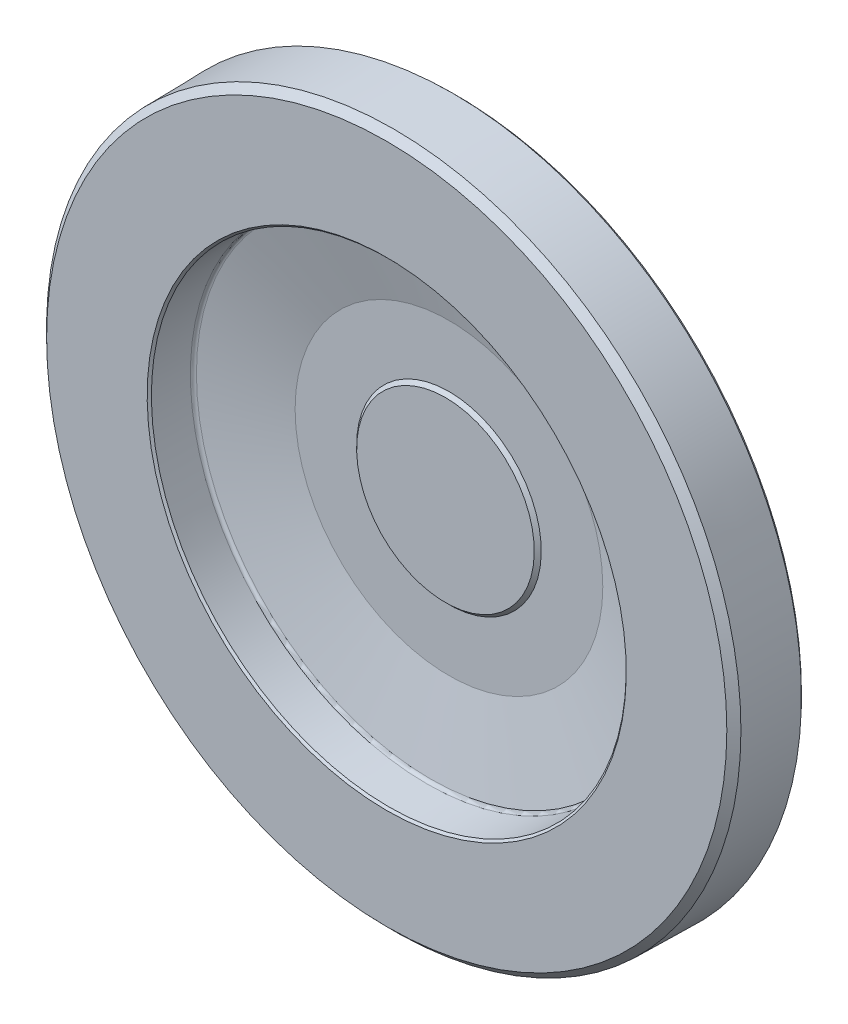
ISO-10303-21;
HEADER;
FILE_DESCRIPTION(('STEP AP214'),'2;1');
FILE_NAME('part.step','',(''),(''),'','','');
FILE_SCHEMA(('AUTOMOTIVE_DESIGN { 1 0 10303 214 1 1 1 1 }'));
ENDSEC;
DATA;
#1=APPLICATION_CONTEXT('core data for automotive mechanical design processes');
#2=APPLICATION_PROTOCOL_DEFINITION('international standard','automotive_design',2000,#1);
#3=PRODUCT_CONTEXT('',#1,'mechanical');
#4=PRODUCT('Part','Part','',(#3));
#5=PRODUCT_RELATED_PRODUCT_CATEGORY('part','',(#4));
#6=PRODUCT_DEFINITION_FORMATION('','',#4);
#7=PRODUCT_DEFINITION_CONTEXT('part definition',#1,'design');
#8=PRODUCT_DEFINITION('design','',#6,#7);
#9=PRODUCT_DEFINITION_SHAPE('','',#8);
#10=(LENGTH_UNIT() NAMED_UNIT(*) SI_UNIT(.MILLI.,.METRE.));
#11=(NAMED_UNIT(*) PLANE_ANGLE_UNIT() SI_UNIT($,.RADIAN.));
#12=(NAMED_UNIT(*) SI_UNIT($,.STERADIAN.) SOLID_ANGLE_UNIT());
#13=UNCERTAINTY_MEASURE_WITH_UNIT(LENGTH_MEASURE(1.E-05),#10,'distance_accuracy_value','');
#14=(GEOMETRIC_REPRESENTATION_CONTEXT(3) GLOBAL_UNCERTAINTY_ASSIGNED_CONTEXT((#13)) GLOBAL_UNIT_ASSIGNED_CONTEXT((#10,
#11,#12)) REPRESENTATION_CONTEXT('',''));
#15=CARTESIAN_POINT('',(0.,0.,0.));
#16=DIRECTION('',(0.,0.,1.));
#17=DIRECTION('',(1.,0.,0.));
#18=AXIS2_PLACEMENT_3D('',#15,#16,#17);
#19=CARTESIAN_POINT('',(0.,0.,44.));
#20=DIRECTION('',(0.,0.,-1.));
#21=DIRECTION('',(0.,1.,0.));
#22=AXIS2_PLACEMENT_3D('',#19,#20,#21);
#23=PLANE('',#22);
#24=CARTESIAN_POINT('',(0.,0.,44.));
#25=DIRECTION('',(0.,0.,-1.));
#26=DIRECTION('',(0.,1.,0.));
#27=AXIS2_PLACEMENT_3D('',#24,#25,#26);
#28=CIRCLE('',#27,31.75);
#29=CARTESIAN_POINT('',(0.,31.75,44.));
#30=VERTEX_POINT('',#29);
#31=EDGE_CURVE('E15',#30,#30,#28,.T.);
#32=ORIENTED_EDGE('',*,*,#31,.F.);
#33=EDGE_LOOP('',(#32));
#34=FACE_BOUND('',#33,.T.);
#35=ADVANCED_FACE('F12',(#34),#23,.F.);
#36=CARTESIAN_POINT('',(0.,0.,42.75));
#37=DIRECTION('',(0.,0.,-1.));
#38=DIRECTION('',(0.,1.,0.));
#39=AXIS2_PLACEMENT_3D('',#36,#37,#38);
#40=CONICAL_SURFACE('',#39,33.,0.785398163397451);
#41=ORIENTED_EDGE('',*,*,#31,.T.);
#42=EDGE_LOOP('',(#41));
#43=FACE_BOUND('',#42,.T.);
#44=CARTESIAN_POINT('',(0.,0.,42.75));
#45=DIRECTION('',(0.,0.,-1.));
#46=DIRECTION('',(0.,1.,0.));
#47=AXIS2_PLACEMENT_3D('',#44,#45,#46);
#48=CIRCLE('',#47,33.);
#49=CARTESIAN_POINT('',(0.,33.,42.75));
#50=VERTEX_POINT('',#49);
#51=EDGE_CURVE('E54',#50,#50,#48,.F.);
#52=ORIENTED_EDGE('',*,*,#51,.T.);
#53=EDGE_LOOP('',(#52));
#54=FACE_BOUND('',#53,.T.);
#55=ADVANCED_FACE('F61',(#43,#54),#40,.T.);
#56=CARTESIAN_POINT('',(23.75,0.,0.));
#57=DIRECTION('',(0.,0.,1.));
#58=DIRECTION('',(0.,-1.,0.));
#59=AXIS2_PLACEMENT_3D('',#56,#57,#58);
#60=PLANE('',#59);
#61=CARTESIAN_POINT('',(0.,0.,0.));
#62=DIRECTION('',(0.,0.,1.));
#63=DIRECTION('',(-1.,0.,0.));
#64=AXIS2_PLACEMENT_3D('',#61,#62,#63);
#65=CIRCLE('',#64,23.75);
#66=CARTESIAN_POINT('',(-23.75,0.,0.));
#67=VERTEX_POINT('',#66);
#68=EDGE_CURVE('E52',#67,#67,#65,.T.);
#69=ORIENTED_EDGE('',*,*,#68,.F.);
#70=EDGE_LOOP('',(#69));
#71=FACE_BOUND('',#70,.T.);
#72=ADVANCED_FACE('F68',(#71),#60,.F.);
#73=CARTESIAN_POINT('',(33.,0.,42.75));
#74=DIRECTION('',(0.,0.,-1.));
#75=DIRECTION('',(0.,1.,0.));
#76=AXIS2_PLACEMENT_3D('',#73,#74,#75);
#77=PLANE('',#76);
#78=ORIENTED_EDGE('',*,*,#51,.F.);
#79=EDGE_LOOP('',(#78));
#80=FACE_BOUND('',#79,.T.);
#81=CARTESIAN_POINT('',(0.,0.,42.75));
#82=DIRECTION('',(0.,0.,1.));
#83=DIRECTION('',(-1.,0.,0.));
#84=AXIS2_PLACEMENT_3D('',#81,#82,#83);
#85=CIRCLE('',#84,55.);
#86=CARTESIAN_POINT('',(-55.,0.,42.75));
#87=VERTEX_POINT('',#86);
#88=EDGE_CURVE('E48',#87,#87,#85,.T.);
#89=ORIENTED_EDGE('',*,*,#88,.T.);
#90=EDGE_LOOP('',(#89));
#91=FACE_BOUND('',#90,.T.);
#92=ADVANCED_FACE('F159',(#80,#91),#77,.F.);
#93=CARTESIAN_POINT('',(0.,0.,0.75));
#94=DIRECTION('',(0.,0.,1.));
#95=DIRECTION('',(-1.,0.,0.));
#96=AXIS2_PLACEMENT_3D('',#93,#94,#95);
#97=CONICAL_SURFACE('',#96,24.5,0.785398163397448);
#98=CARTESIAN_POINT('',(0.,0.,0.75));
#99=DIRECTION('',(0.,0.,1.));
#100=DIRECTION('',(0.,-1.,0.));
#101=AXIS2_PLACEMENT_3D('',#98,#99,#100);
#102=CIRCLE('',#101,24.5);
#103=CARTESIAN_POINT('',(0.,-24.5,0.75));
#104=VERTEX_POINT('',#103);
#105=EDGE_CURVE('E51',#104,#104,#102,.T.);
#106=ORIENTED_EDGE('',*,*,#105,.F.);
#107=EDGE_LOOP('',(#106));
#108=FACE_BOUND('',#107,.T.);
#109=ORIENTED_EDGE('',*,*,#68,.T.);
#110=EDGE_LOOP('',(#109));
#111=FACE_BOUND('',#110,.T.);
#112=ADVANCED_FACE('F155',(#108,#111),#97,.T.);
#113=CARTESIAN_POINT('',(0.,0.,49.3675614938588));
#114=DIRECTION('',(0.,0.,1.));
#115=DIRECTION('',(-1.,0.,0.));
#116=AXIS2_PLACEMENT_3D('',#113,#114,#115);
#117=CONICAL_SURFACE('',#116,83.6638079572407,1.34390352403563);
#118=ORIENTED_EDGE('',*,*,#88,.F.);
#119=EDGE_LOOP('',(#118));
#120=FACE_BOUND('',#119,.T.);
#121=CARTESIAN_POINT('',(0.,0.,49.3675614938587));
#122=DIRECTION('',(0.,0.,-1.));
#123=DIRECTION('',(0.,1.,0.));
#124=AXIS2_PLACEMENT_3D('',#121,#122,#123);
#125=CIRCLE('',#124,83.6638079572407);
#126=CARTESIAN_POINT('',(0.,83.6638079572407,49.3675614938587));
#127=VERTEX_POINT('',#126);
#128=EDGE_CURVE('E47',#127,#127,#125,.F.);
#129=ORIENTED_EDGE('',*,*,#128,.T.);
#130=EDGE_LOOP('',(#129));
#131=FACE_BOUND('',#130,.T.);
#132=ADVANCED_FACE('F158',(#120,#131),#117,.F.);
#133=CARTESIAN_POINT('',(0.,0.,0.));
#134=DIRECTION('',(0.,0.,1.));
#135=DIRECTION('',(0.,-1.,0.));
#136=AXIS2_PLACEMENT_3D('',#133,#134,#135);
#137=CYLINDRICAL_SURFACE('',#136,24.5);
#138=CARTESIAN_POINT('',(0.,0.,15.));
#139=DIRECTION('',(0.,0.,1.));
#140=DIRECTION('',(0.,-1.,0.));
#141=AXIS2_PLACEMENT_3D('',#138,#139,#140);
#142=CIRCLE('',#141,24.5);
#143=CARTESIAN_POINT('',(0.,-24.5,15.));
#144=VERTEX_POINT('',#143);
#145=EDGE_CURVE('E44',#144,#144,#142,.F.);
#146=ORIENTED_EDGE('',*,*,#145,.T.);
#147=EDGE_LOOP('',(#146));
#148=FACE_BOUND('',#147,.T.);
#149=ORIENTED_EDGE('',*,*,#105,.T.);
#150=EDGE_LOOP('',(#149));
#151=FACE_BOUND('',#150,.T.);
#152=ADVANCED_FACE('F140',(#148,#151),#137,.T.);
#153=CARTESIAN_POINT('',(0.,0.,50.5855240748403));
#154=DIRECTION('',(0.,0.,-1.));
#155=DIRECTION('',(0.,1.,0.));
#156=AXIS2_PLACEMENT_3D('',#153,#154,#155);
#157=TOROIDAL_SURFACE('',#156,83.3826191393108,1.25000000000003);
#158=ORIENTED_EDGE('',*,*,#128,.F.);
#159=EDGE_LOOP('',(#158));
#160=FACE_BOUND('',#159,.T.);
#161=CARTESIAN_POINT('',(0.,0.,50.563708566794));
#162=DIRECTION('',(0.,0.,1.));
#163=DIRECTION('',(0.,-1.,0.));
#164=AXIS2_PLACEMENT_3D('',#161,#162,#163);
#165=CIRCLE('',#164,84.6324287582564);
#166=CARTESIAN_POINT('',(0.,-84.6324287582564,50.5637085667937));
#167=VERTEX_POINT('',#166);
#168=EDGE_CURVE('E43',#167,#167,#165,.T.);
#169=ORIENTED_EDGE('',*,*,#168,.T.);
#170=EDGE_LOOP('',(#169));
#171=FACE_BOUND('',#170,.T.);
#172=ADVANCED_FACE('F135',(#160,#171),#157,.F.);
#173=CARTESIAN_POINT('',(35.,0.,15.));
#174=DIRECTION('',(0.,0.,1.));
#175=DIRECTION('',(0.,-1.,0.));
#176=AXIS2_PLACEMENT_3D('',#173,#174,#175);
#177=PLANE('',#176);
#178=CARTESIAN_POINT('',(0.,0.,15.));
#179=DIRECTION('',(0.,0.,1.));
#180=DIRECTION('',(0.,-1.,0.));
#181=AXIS2_PLACEMENT_3D('',#178,#179,#180);
#182=CIRCLE('',#181,35.);
#183=CARTESIAN_POINT('',(0.,-35.,15.));
#184=VERTEX_POINT('',#183);
#185=EDGE_CURVE('E39',#184,#184,#182,.T.);
#186=ORIENTED_EDGE('',*,*,#185,.F.);
#187=EDGE_LOOP('',(#186));
#188=FACE_BOUND('',#187,.T.);
#189=ORIENTED_EDGE('',*,*,#145,.F.);
#190=EDGE_LOOP('',(#189));
#191=FACE_BOUND('',#190,.T.);
#192=ADVANCED_FACE('F131',(#188,#191),#177,.F.);
#193=CARTESIAN_POINT('',(0.,0.,64.2501142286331));
#194=DIRECTION('',(0.,0.,1.));
#195=DIRECTION('',(0.,-1.,0.));
#196=AXIS2_PLACEMENT_3D('',#193,#194,#195);
#197=CONICAL_SURFACE('',#196,84.8713258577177,0.0174532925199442);
#198=ORIENTED_EDGE('',*,*,#168,.F.);
#199=EDGE_LOOP('',(#198));
#200=FACE_BOUND('',#199,.T.);
#201=CARTESIAN_POINT('',(0.,0.,64.2501142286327));
#202=DIRECTION('',(0.,0.,1.));
#203=DIRECTION('',(0.,-1.,0.));
#204=AXIS2_PLACEMENT_3D('',#201,#202,#203);
#205=CIRCLE('',#204,84.8713258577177);
#206=CARTESIAN_POINT('',(0.,-84.8713258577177,64.2501142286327));
#207=VERTEX_POINT('',#206);
#208=EDGE_CURVE('E42',#207,#207,#205,.T.);
#209=ORIENTED_EDGE('',*,*,#208,.T.);
#210=EDGE_LOOP('',(#209));
#211=FACE_BOUND('',#210,.T.);
#212=ADVANCED_FACE('F127',(#200,#211),#197,.F.);
#213=CARTESIAN_POINT('',(0.,0.,0.));
#214=DIRECTION('',(0.,0.,1.));
#215=DIRECTION('',(0.,-1.,0.));
#216=AXIS2_PLACEMENT_3D('',#213,#214,#215);
#217=CYLINDRICAL_SURFACE('',#216,35.);
#218=CARTESIAN_POINT('',(0.,0.,25.6909579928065));
#219=DIRECTION('',(0.,0.,-1.));
#220=DIRECTION('',(0.,1.,0.));
#221=AXIS2_PLACEMENT_3D('',#218,#219,#220);
#222=CIRCLE('',#221,35.);
#223=CARTESIAN_POINT('',(0.,35.,25.6909579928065));
#224=VERTEX_POINT('',#223);
#225=EDGE_CURVE('E38',#224,#224,#222,.T.);
#226=ORIENTED_EDGE('',*,*,#225,.T.);
#227=EDGE_LOOP('',(#226));
#228=FACE_BOUND('',#227,.T.);
#229=ORIENTED_EDGE('',*,*,#185,.T.);
#230=EDGE_LOOP('',(#229));
#231=FACE_BOUND('',#230,.T.);
#232=ADVANCED_FACE('F123',(#228,#231),#217,.T.);
#233=CARTESIAN_POINT('',(0.,0.,65.));
#234=DIRECTION('',(0.,0.,1.));
#235=DIRECTION('',(0.,-1.,0.));
#236=AXIS2_PLACEMENT_3D('',#233,#234,#235);
#237=CONICAL_SURFACE('',#236,85.6344151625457,0.79412480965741);
#238=ORIENTED_EDGE('',*,*,#208,.F.);
#239=EDGE_LOOP('',(#238));
#240=FACE_BOUND('',#239,.T.);
#241=CARTESIAN_POINT('',(0.,0.,65.));
#242=DIRECTION('',(0.,0.,1.));
#243=DIRECTION('',(0.,-1.,0.));
#244=AXIS2_PLACEMENT_3D('',#241,#242,#243);
#245=CIRCLE('',#244,85.6344151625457);
#246=CARTESIAN_POINT('',(0.,-85.6344151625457,65.));
#247=VERTEX_POINT('',#246);
#248=EDGE_CURVE('E35',#247,#247,#245,.T.);
#249=ORIENTED_EDGE('',*,*,#248,.T.);
#250=EDGE_LOOP('',(#249));
#251=FACE_BOUND('',#250,.T.);
#252=ADVANCED_FACE('F119',(#240,#251),#237,.F.);
#253=CARTESIAN_POINT('',(0.,0.,25.6909579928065));
#254=DIRECTION('',(0.,0.,-1.));
#255=DIRECTION('',(0.,1.,0.));
#256=AXIS2_PLACEMENT_3D('',#253,#254,#255);
#257=TOROIDAL_SURFACE('',#256,37.5,2.5);
#258=CARTESIAN_POINT('',(0.,0.,28.0401895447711));
#259=DIRECTION('',(0.,0.,1.));
#260=DIRECTION('',(0.,-1.,0.));
#261=AXIS2_PLACEMENT_3D('',#258,#259,#260);
#262=CIRCLE('',#261,36.6449496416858);
#263=CARTESIAN_POINT('',(0.,-36.6449496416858,28.0401895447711));
#264=VERTEX_POINT('',#263);
#265=EDGE_CURVE('E34',#264,#264,#262,.T.);
#266=ORIENTED_EDGE('',*,*,#265,.F.);
#267=EDGE_LOOP('',(#266));
#268=FACE_BOUND('',#267,.T.);
#269=ORIENTED_EDGE('',*,*,#225,.F.);
#270=EDGE_LOOP('',(#269));
#271=FACE_BOUND('',#270,.T.);
#272=ADVANCED_FACE('F114',(#268,#271),#257,.F.);
#273=CARTESIAN_POINT('',(85.6344151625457,0.,65.));
#274=DIRECTION('',(0.,0.,-1.));
#275=DIRECTION('',(0.,1.,0.));
#276=AXIS2_PLACEMENT_3D('',#273,#274,#275);
#277=PLANE('',#276);
#278=ORIENTED_EDGE('',*,*,#248,.F.);
#279=EDGE_LOOP('',(#278));
#280=FACE_BOUND('',#279,.T.);
#281=CARTESIAN_POINT('',(0.,0.,65.));
#282=DIRECTION('',(0.,0.,-1.));
#283=DIRECTION('',(1.,0.,0.));
#284=AXIS2_PLACEMENT_3D('',#281,#282,#283);
#285=CIRCLE('',#284,121.585442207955);
#286=CARTESIAN_POINT('',(121.585442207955,0.,65.));
#287=VERTEX_POINT('',#286);
#288=EDGE_CURVE('E30',#287,#287,#285,.T.);
#289=ORIENTED_EDGE('',*,*,#288,.F.);
#290=EDGE_LOOP('',(#289));
#291=FACE_BOUND('',#290,.T.);
#292=ADVANCED_FACE('F118',(#280,#291),#277,.F.);
#293=CARTESIAN_POINT('',(0.,0.,44.8894307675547));
#294=DIRECTION('',(0.,0.,1.));
#295=DIRECTION('',(0.,-1.,0.));
#296=AXIS2_PLACEMENT_3D('',#293,#294,#295);
#297=CONICAL_SURFACE('',#296,82.9378594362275,1.22173047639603);
#298=CARTESIAN_POINT('',(0.,0.,44.8894307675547));
#299=DIRECTION('',(0.,0.,-1.));
#300=DIRECTION('',(0.,1.,0.));
#301=AXIS2_PLACEMENT_3D('',#298,#299,#300);
#302=CIRCLE('',#301,82.9378594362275);
#303=CARTESIAN_POINT('',(0.,82.9378594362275,44.8894307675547));
#304=VERTEX_POINT('',#303);
#305=EDGE_CURVE('E33',#304,#304,#302,.T.);
#306=ORIENTED_EDGE('',*,*,#305,.T.);
#307=EDGE_LOOP('',(#306));
#308=FACE_BOUND('',#307,.T.);
#309=ORIENTED_EDGE('',*,*,#265,.T.);
#310=EDGE_LOOP('',(#309));
#311=FACE_BOUND('',#310,.T.);
#312=ADVANCED_FACE('F201',(#308,#311),#297,.T.);
#313=CARTESIAN_POINT('',(0.,0.,62.5003807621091));
#314=DIRECTION('',(0.,0.,-1.));
#315=DIRECTION('',(1.,0.,0.));
#316=AXIS2_PLACEMENT_3D('',#313,#314,#315);
#317=CONICAL_SURFACE('',#316,124.129073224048,0.794124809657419);
#318=ORIENTED_EDGE('',*,*,#288,.T.);
#319=EDGE_LOOP('',(#318));
#320=FACE_BOUND('',#319,.T.);
#321=CARTESIAN_POINT('',(0.,0.,62.500380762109));
#322=DIRECTION('',(0.,0.,-1.));
#323=DIRECTION('',(0.,1.,0.));
#324=AXIS2_PLACEMENT_3D('',#321,#322,#323);
#325=CIRCLE('',#324,124.129073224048);
#326=CARTESIAN_POINT('',(0.,124.129073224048,62.5003807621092));
#327=VERTEX_POINT('',#326);
#328=EDGE_CURVE('E103',#327,#327,#325,.T.);
#329=ORIENTED_EDGE('',*,*,#328,.F.);
#330=EDGE_LOOP('',(#329));
#331=FACE_BOUND('',#330,.T.);
#332=ADVANCED_FACE('F93',(#320,#331),#317,.T.);
#333=CARTESIAN_POINT('',(0.,0.,43.7148149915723));
#334=DIRECTION('',(0.,0.,-1.));
#335=DIRECTION('',(0.,1.,0.));
#336=AXIS2_PLACEMENT_3D('',#333,#334,#335);
#337=TOROIDAL_SURFACE('',#336,83.3653846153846,1.25000000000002);
#338=CARTESIAN_POINT('',(0.,0.,43.7148149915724));
#339=DIRECTION('',(0.,0.,1.));
#340=DIRECTION('',(0.,-1.,0.));
#341=AXIS2_PLACEMENT_3D('',#338,#339,#340);
#342=CIRCLE('',#341,84.6153846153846);
#343=CARTESIAN_POINT('',(0.,-84.6153846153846,43.7148149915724));
#344=VERTEX_POINT('',#343);
#345=EDGE_CURVE('E208',#344,#344,#342,.F.);
#346=ORIENTED_EDGE('',*,*,#345,.T.);
#347=EDGE_LOOP('',(#346));
#348=FACE_BOUND('',#347,.T.);
#349=ORIENTED_EDGE('',*,*,#305,.F.);
#350=EDGE_LOOP('',(#349));
#351=FACE_BOUND('',#350,.T.);
#352=ADVANCED_FACE('F88',(#348,#351),#337,.F.);
#353=CARTESIAN_POINT('',(0.,0.,41.2498096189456));
#354=DIRECTION('',(0.,0.,-1.));
#355=DIRECTION('',(0.,1.,0.));
#356=AXIS2_PLACEMENT_3D('',#353,#354,#355);
#357=CONICAL_SURFACE('',#356,124.500003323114,0.0174532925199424);
#358=ORIENTED_EDGE('',*,*,#328,.T.);
#359=EDGE_LOOP('',(#358));
#360=FACE_BOUND('',#359,.T.);
#361=CARTESIAN_POINT('',(0.,0.,41.2498096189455));
#362=DIRECTION('',(0.,0.,1.));
#363=DIRECTION('',(0.,-1.,0.));
#364=AXIS2_PLACEMENT_3D('',#361,#362,#363);
#365=CIRCLE('',#364,124.500003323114);
#366=CARTESIAN_POINT('',(0.,-124.500003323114,41.2498096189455));
#367=VERTEX_POINT('',#366);
#368=EDGE_CURVE('E24',#367,#367,#365,.F.);
#369=ORIENTED_EDGE('',*,*,#368,.F.);
#370=EDGE_LOOP('',(#369));
#371=FACE_BOUND('',#370,.T.);
#372=ADVANCED_FACE('F84',(#360,#371),#357,.T.);
#373=CARTESIAN_POINT('',(0.,0.,0.));
#374=DIRECTION('',(0.,0.,1.));
#375=DIRECTION('',(0.,-1.,0.));
#376=AXIS2_PLACEMENT_3D('',#373,#374,#375);
#377=CYLINDRICAL_SURFACE('',#376,84.6153846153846);
#378=CARTESIAN_POINT('',(0.,0.,40.));
#379=DIRECTION('',(0.,0.,1.));
#380=DIRECTION('',(0.,-1.,0.));
#381=AXIS2_PLACEMENT_3D('',#378,#379,#380);
#382=CIRCLE('',#381,84.6153846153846);
#383=CARTESIAN_POINT('',(0.,-84.6153846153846,40.));
#384=VERTEX_POINT('',#383);
#385=EDGE_CURVE('E19',#384,#384,#382,.F.);
#386=ORIENTED_EDGE('',*,*,#385,.T.);
#387=EDGE_LOOP('',(#386));
#388=FACE_BOUND('',#387,.T.);
#389=ORIENTED_EDGE('',*,*,#345,.F.);
#390=EDGE_LOOP('',(#389));
#391=FACE_BOUND('',#390,.T.);
#392=ADVANCED_FACE('F77',(#388,#391),#377,.F.);
#393=CARTESIAN_POINT('',(0.,0.,41.2498096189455));
#394=DIRECTION('',(0.,0.,1.));
#395=DIRECTION('',(0.,-1.,0.));
#396=AXIS2_PLACEMENT_3D('',#393,#394,#395);
#397=CONICAL_SURFACE('',#396,124.500003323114,0.776671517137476);
#398=ORIENTED_EDGE('',*,*,#368,.T.);
#399=EDGE_LOOP('',(#398));
#400=FACE_BOUND('',#399,.T.);
#401=CARTESIAN_POINT('',(0.,0.,40.));
#402=DIRECTION('',(0.,0.,1.));
#403=DIRECTION('',(0.,-1.,0.));
#404=AXIS2_PLACEMENT_3D('',#401,#402,#403);
#405=CIRCLE('',#404,123.27181883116);
#406=CARTESIAN_POINT('',(0.,-123.27181883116,40.));
#407=VERTEX_POINT('',#406);
#408=EDGE_CURVE('E8',#407,#407,#405,.T.);
#409=ORIENTED_EDGE('',*,*,#408,.T.);
#410=EDGE_LOOP('',(#409));
#411=FACE_BOUND('',#410,.T.);
#412=ADVANCED_FACE('F71',(#400,#411),#397,.T.);
#413=CARTESIAN_POINT('',(123.27181883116,0.,40.));
#414=DIRECTION('',(0.,0.,1.));
#415=DIRECTION('',(0.,-1.,0.));
#416=AXIS2_PLACEMENT_3D('',#413,#414,#415);
#417=PLANE('',#416);
#418=ORIENTED_EDGE('',*,*,#408,.F.);
#419=EDGE_LOOP('',(#418));
#420=FACE_BOUND('',#419,.T.);
#421=ORIENTED_EDGE('',*,*,#385,.F.);
#422=EDGE_LOOP('',(#421));
#423=FACE_BOUND('',#422,.T.);
#424=ADVANCED_FACE('F69',(#420,#423),#417,.F.);
#425=CLOSED_SHELL('',(#35,#55,#72,#92,#112,#132,#152,#172,#192,#212,#232,#252,#272,#292,#312,
#332,#352,#372,#392,#412,#424));
#426=MANIFOLD_SOLID_BREP('B1',#425);
#427=ADVANCED_BREP_SHAPE_REPRESENTATION('',(#18,#426),#14);
#428=SHAPE_DEFINITION_REPRESENTATION(#9,#427);
ENDSEC;
END-ISO-10303-21;
